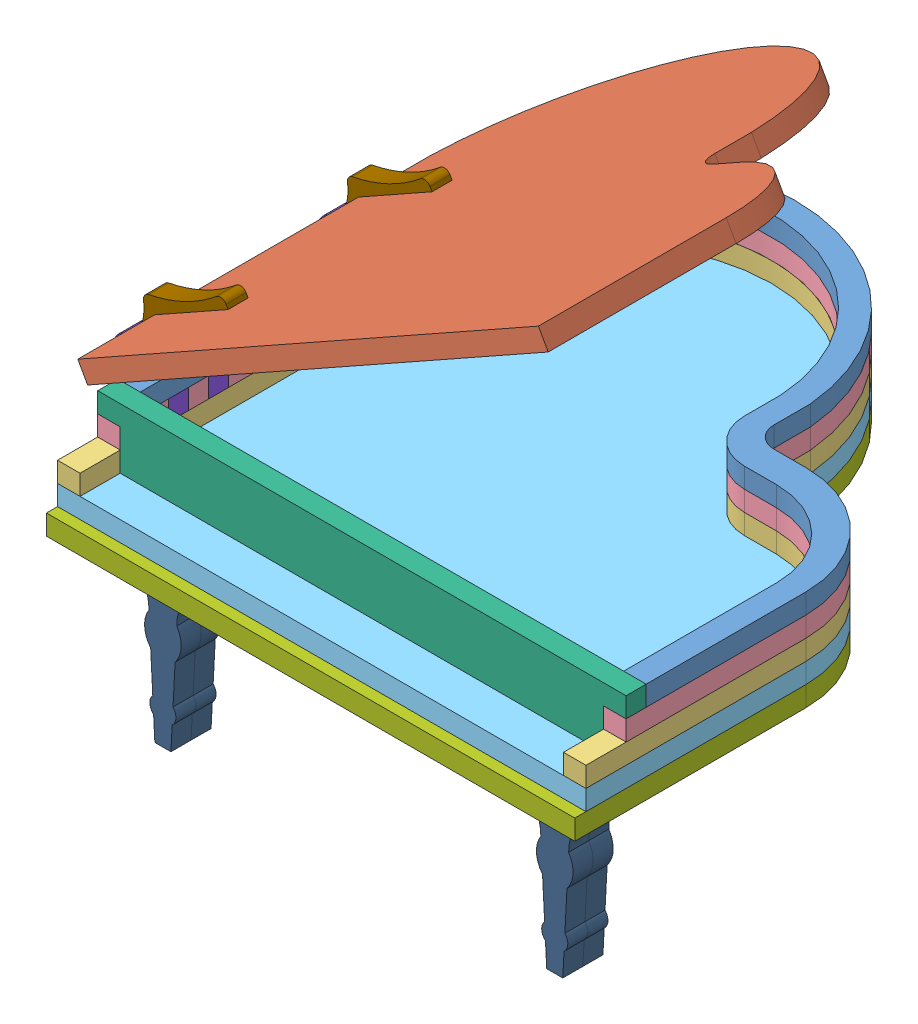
SolidWorks assembly Assem.SLDASM, configuration Default (file format 10000). Lengths in mm.
Overall size (91.11 88.14 89.32).
19 component instances, 10 part files, 54 mates.
Components (placement in the parent):
- rim-1: rim.SLDPRT [Default] at origin size (83.57 3.17 78.04)
- lid-1: lid.SLDPRT [Default] at (-10.1654 42.0059 0) x (0.871727 0.489992 0) z (0 0 1) size (83.57 3.17 82.48)
- rim3-2: rim3.SLDPRT [Default] at (0 -6.35 0) size (83.57 3.17 87.56)
- rim2-3: rim2.SLDPRT [Default] at (0 -3.175 0) size (83.57 3.17 81.21)
- lid-keys-1: lid-keys.SLDPRT [Default] at (0 -9.525 0) size (83.57 3.17 87.56)
- front-1: front.SLDPRT [Default] at (-76.708 -6.35 38.608) size (83.57 9.53 3.17)
- lid-bottom-1: lid-bottom.SLDPRT [Default] at (0 -12.7 0) size (83.57 3.17 89.32)
- bottom-hinge-1: bottom-hinge.SLDPRT [Default] at (-79.248 3.175 -10.8738) size (8.64 12.7 3.17)
- bottom-hinge-2: bottom-hinge.SLDPRT [Default] at (-79.248 3.175 -4.5238) size (8.64 12.7 3.17)
- bottom-hinge-3: bottom-hinge.SLDPRT [Default] at (-79.248 3.175 21.463) size (8.64 12.7 3.17)
- bottom-hinge-4: bottom-hinge.SLDPRT [Default] at (-79.248 3.175 27.813) size (8.64 12.7 3.17)
- top-hinge-1: top-hinge.SLDPRT [Default] at (-79.248 3.175 24.5592) x (0.871727 0.489992 0) z (0 0 1) size (18.41 8.24 3.17)
- top-hinge-2: top-hinge.SLDPRT [Default] at (-79.248 3.175 -7.6988) x (0.871727 0.489992 0) z (0 0 1) size (18.41 8.24 3.17)
- leg-1: leg.SLDPRT [Default] at (-3.937 -9.525 32.7452) size (13.97 30.48 3.17)
- leg-2: leg.SLDPRT [Default] at (-65.913 -9.525 35.9202) size (13.97 30.48 3.17)
- leg-3: leg.SLDPRT [Default] at (-65.913 -9.525 32.7452) size (13.97 30.48 3.17)
- leg-4: leg.SLDPRT [Default] at (-3.937 -9.525 35.9202) size (13.97 30.48 3.17)
- leg-5: leg.SLDPRT [Default] at (-46.863 -9.525 -25.6748) size (13.97 30.48 3.17)
- leg-6: leg.SLDPRT [Default] at (-46.863 -9.525 -28.8498) size (13.97 30.48 3.17)
Mates (geometry in assembly coordinates):
- Coincident6: coincident anti-aligned: plane of rim-1 through (0 0 0) normal (0 -1 0); plane of rim2-3 through (0 0 0) normal (0 1 0)
- Coincident7: coincident aligned: plane of rim-1 through (-76.708 3.175 0) normal (-1 0 0); plane of rim2-3 through (-76.708 0 0) normal (-1 0 0)
- Coincident13: coincident anti-aligned: plane of rim3-2 through (0 -3.175 0) normal (0 1 0); plane of rim2-3 through (0 -3.175 0) normal (0 -1 0)
- Coincident14: coincident aligned: plane of rim-1 through (-76.708 3.175 0) normal (-1 0 0); plane of rim3-2 through (-76.708 -3.175 0) normal (-1 0 0)
- Coincident17: coincident anti-aligned: plane of rim3-2 through (0 -6.35 0) normal (0 -1 0); plane of lid-keys-1 through (0 -6.35 0) normal (0 1 0)
- Coincident18: coincident aligned: plane of rim-1 through (-76.708 3.175 0) normal (-1 0 0); plane of lid-keys-1 through (-76.708 -6.35 0) normal (-1 0 0)
- Concentric1: concentric aligned: cylinder of rim3-2 through (-47.625 -3.175 -13.4126) axis (0 -1 0) radius 29.1938; cylinder of lid-keys-1 through (-47.625 -6.35 -13.4126) axis (0 -1 0) radius 29.1938
- Coincident20: coincident anti-aligned: plane of rim2-3 through (3.302 0 0) normal (-1 0 0); plane of front-1 through (3.302 -6.35 35.433) normal (1 0 0)
- Coincident21: coincident anti-aligned: plane of lid-keys-1 through (0 -6.35 0) normal (0 1 0); plane of front-1 through (-76.708 -6.35 35.433) normal (0 -1 0)
- Coincident22: coincident anti-aligned: plane of lid-keys-1 through (0 -9.525 0) normal (0 -1 0); plane of lid-bottom-1 through (0 -9.525 0) normal (0 1 0)
- Concentric2: concentric aligned: cylinder of lid-keys-1 through (-47.625 -6.35 -13.4126) axis (0 -1 0) radius 29.1938; cylinder of lid-bottom-1 through (-47.625 -9.525 -13.4126) axis (0 -1 0) radius 29.1938
- Coincident23: coincident anti-aligned: plane of rim3-2 through (0 -3.175 0) normal (0 1 0); plane of bottom-hinge-1 through (-73.152 -3.175 -7.6988) normal (0 -1 0)
- Coincident24: coincident anti-aligned: plane of rim2-3 through (6.859 0 -7.6988) normal (0 0 -1); plane of bottom-hinge-1 through (-79.248 3.175 -7.6988) normal (0 0 1)
- Coincident25: coincident anti-aligned: plane of rim2-3 through (-76.708 0 0) normal (-1 0 0); plane of bottom-hinge-1 through (-76.708 3.175 -7.6988) normal (1 0 0)
- Coincident26: coincident anti-aligned: plane of rim3-2 through (0 -3.175 0) normal (0 1 0); plane of bottom-hinge-2 through (-73.152 -3.175 -1.3488) normal (0 -1 0)
- Coincident27: coincident anti-aligned: plane of rim2-3 through (6.859 0 -4.5238) normal (0 0 1); plane of bottom-hinge-2 through (-79.248 3.175 -4.5238) normal (0 0 -1)
- Coincident28: coincident anti-aligned: plane of rim2-3 through (6.859 0 24.638) normal (0 0 -1); plane of bottom-hinge-3 through (-79.248 3.175 24.638) normal (0 0 1)
- Concentric3: concentric aligned: cylinder of rim-1 through (-47.625 3.175 -13.4126) axis (0 -1 0) radius 29.1938; cylinder of rim2-3 through (-47.625 0 -13.4126) axis (0 -1 0) radius 29.1938
- Coincident29: coincident anti-aligned: plane of rim3-2 through (0 -3.175 0) normal (0 1 0); plane of bottom-hinge-3 through (-73.152 -3.175 24.638) normal (0 -1 0)
- Coincident30: coincident anti-aligned: plane of rim3-2 through (0 -3.175 0) normal (0 1 0); plane of bottom-hinge-4 through (-73.152 -3.175 30.988) normal (0 -1 0)
- Coincident31: coincident anti-aligned: plane of rim2-3 through (6.859 0 27.813) normal (0 0 1); plane of bottom-hinge-4 through (-79.248 3.175 27.813) normal (0 0 -1)
- Coincident32: coincident anti-aligned: plane of rim2-3 through (-76.708 0 0) normal (-1 0 0); plane of bottom-hinge-4 through (-76.708 3.175 30.988) normal (1 0 0)
- Coincident33: coincident anti-aligned: plane of rim2-3 through (-76.708 0 0) normal (-1 0 0); plane of bottom-hinge-3 through (-76.708 3.175 24.638) normal (1 0 0)
- Coincident34: coincident anti-aligned: plane of rim2-3 through (-76.708 0 0) normal (-1 0 0); plane of bottom-hinge-2 through (-76.708 3.175 -1.3488) normal (1 0 0)
- Coincident35: coincident anti-aligned: plane of rim-1 through (0 3.175 35.433) normal (0 0 1); plane of front-1 through (-76.708 -6.35 35.433) normal (0 0 -1)
- Coincident36: coincident anti-aligned: plane of rim3-2 through (0 -3.175 0) normal (0 1 0); plane of rim2-3 through (0 -3.175 0) normal (0 -1 0)
- Concentric4: concentric aligned: cylinder of rim3-2 through (-47.625 -3.175 -13.4126) axis (0 -1 0) radius 29.1938; cylinder of rim2-3 through (-47.625 0 -13.4126) axis (0 -1 0) radius 29.1938
- Coincident37: coincident aligned: plane of top-hinge-1 through (-80.8037 5.9427 27.7342) normal (0.489992 -0.871727 0); plane of top-hinge-2 through (-80.8037 5.9427 -4.5238) normal (0.489992 -0.871727 0)
- Coincident38: coincident anti-aligned: plane of lid-1 through (-11.7211 44.7736 0) normal (-0.489992 0.871727 0); plane of top-hinge-2 through (-80.8037 5.9427 -4.5238) normal (0.489992 -0.871727 0)
- Coincident39: coincident anti-aligned: plane of lid-1 through (-68.1771 9.3979 27.7342) normal (0 0 -1); plane of top-hinge-1 through (-79.248 3.175 27.7342) normal (0 0 1)
- Coincident40: coincident anti-aligned: plane of lid-1 through (-68.1771 9.3979 -4.5238) normal (0 0 -1); plane of top-hinge-2 through (-79.248 3.175 -4.5238) normal (0 0 1)
- Coincident41: coincident anti-aligned: plane of lid-1 through (-78.5895 7.1873 0) normal (-0.871727 -0.489992 0); plane of top-hinge-2 through (-77.0338 4.4196 -4.5238) normal (0.871727 0.489992 0)
- Coincident42: coincident anti-aligned: plane of lid-1 through (-78.5895 7.1873 0) normal (-0.871727 -0.489992 0); plane of top-hinge-1 through (-77.0338 4.4196 27.7342) normal (0.871727 0.489992 0)
- Coincident43: coincident anti-aligned: plane of leg-5 through (-56.6801 -22.3141 -25.6748) normal (0 0 -1); plane of leg-6 through (-56.6801 -22.3141 -25.6748) normal (0 0 1)
- Coincident44: coincident aligned: plane of leg-5 through (-43.688 -9.525 -22.4998) normal (0 1 0); plane of leg-6 through (-43.688 -9.525 -25.6748) normal (0 1 0)
- Coincident45: coincident aligned: plane of leg-5 through (-39.878 -12.7 -22.4998) normal (1 0 0); plane of leg-6 through (-39.878 -12.7 -25.6748) normal (1 0 0)
- Coincident46: coincident aligned: plane of leg-1 through (-0.762 -9.525 35.9202) normal (0 1 0); plane of leg-4 through (-0.762 -9.525 39.0952) normal (0 1 0)
- Coincident47: coincident aligned: plane of leg-1 through (-0.762 -9.525 35.9202) normal (1 0 0); plane of leg-4 through (-0.762 -9.525 39.0952) normal (1 0 0)
- Coincident48: coincident anti-aligned: plane of leg-1 through (-13.7541 -22.3141 35.9202) normal (0 0 1); plane of leg-4 through (-13.7541 -22.3141 35.9202) normal (0 0 -1)
- Coincident49: coincident anti-aligned: plane of leg-2 through (-75.7301 -22.3141 35.9202) normal (0 0 -1); plane of leg-3 through (-75.7301 -22.3141 35.9202) normal (0 0 1)
- Coincident50: coincident aligned: plane of leg-2 through (-62.738 -9.525 39.0952) normal (0 1 0); plane of leg-3 through (-62.738 -9.525 35.9202) normal (0 1 0)
- Coincident52: coincident anti-aligned: plane of lid-bottom-1 through (-69.088 -12.7 39.0952) normal (0 0 -1); plane of leg-2 through (-75.7301 -22.3141 39.0952) normal (0 0 1)
- Coincident53: coincident aligned: plane of leg-2 through (-69.088 -9.525 39.0952) normal (-1 0 0); plane of leg-3 through (-69.088 -9.525 35.9202) normal (-1 0 0)
- Coincident54: coincident anti-aligned: plane of lid-bottom-1 through (-69.088 -12.7 39.0952) normal (1 0 0); plane of leg-2 through (-69.088 -9.525 39.0952) normal (-1 0 0)
- Coincident55: coincident anti-aligned: plane of lid-bottom-1 through (0 -12.7 0) normal (0 -1 0); plane of leg-2 through (-62.738 -12.7 39.0952) normal (0 1 0)
- Coincident56: coincident anti-aligned: plane of lid-keys-1 through (0 -9.525 0) normal (0 -1 0); plane of leg-4 through (-0.762 -9.525 39.0952) normal (0 1 0)
- Coincident57: coincident anti-aligned: plane of lid-bottom-1 through (-0.762 -12.7 39.0952) normal (0 0 -1); plane of leg-4 through (-13.7541 -22.3141 39.0952) normal (0 0 1)
- Coincident58: coincident anti-aligned: plane of lid-bottom-1 through (-0.762 -12.7 39.0952) normal (-1 0 0); plane of leg-4 through (-0.762 -9.525 39.0952) normal (1 0 0)
- Coincident59: coincident anti-aligned: plane of lid-bottom-1 through (-43.688 -12.7 -28.8498) normal (-1 0 0); plane of leg-5 through (-43.688 -9.525 -22.4998) normal (1 0 0)
- Coincident60: coincident anti-aligned: plane of lid-bottom-1 through (-50.038 -12.7 -28.8498) normal (0 0 1); plane of leg-6 through (-56.6801 -22.3141 -28.8498) normal (0 0 -1)
- Coincident61: coincident aligned: plane of rim2-3 through (6.858 0 0) normal (1 0 0); plane of lid-bottom-1 through (6.858 -9.525 0) normal (1 0 0)
- Coincident62: coincident anti-aligned: plane of lid-bottom-1 through (0 -12.7 0) normal (0 -1 0); plane of leg-6 through (-43.688 -12.7 -25.6748) normal (0 1 0)
- Concentric5: concentric anti-aligned: circle of bottom-hinge-1; cylinder of top-hinge-2 through (-79.248 3.175 -4.5238) axis (0 0 -1) radius 1.5875
- Coincident63: coincident anti-aligned: plane of bottom-hinge-1 through (-79.248 3.175 -7.6988) normal (0 0 1); plane of top-hinge-2 through (-79.248 3.175 -7.6988) normal (0 0 -1)
